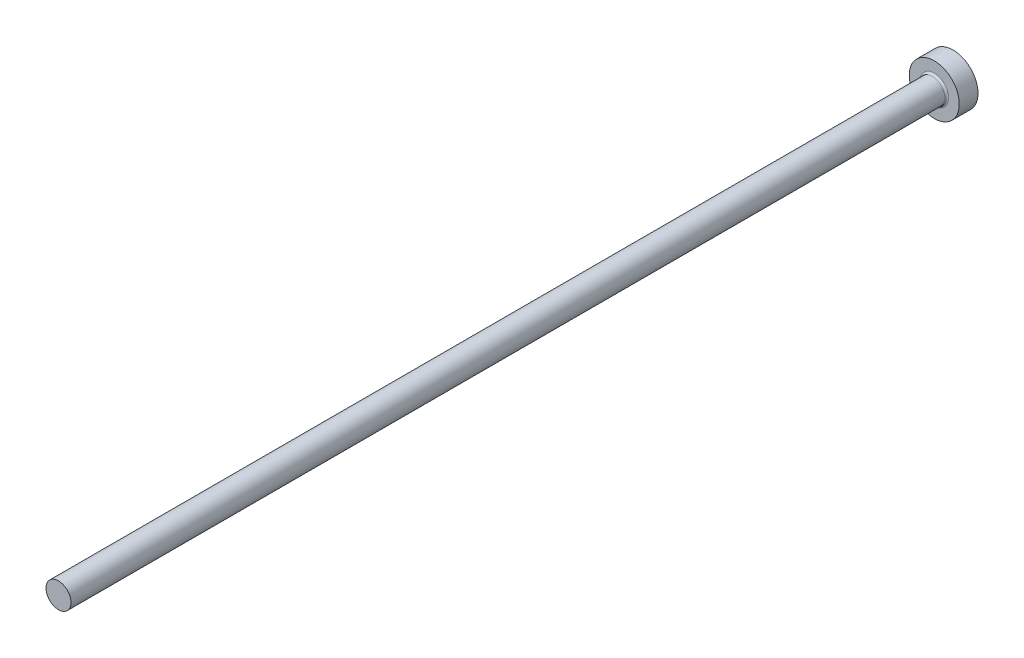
ISO-10303-21;
HEADER;
FILE_DESCRIPTION(('STEP AP214'),'2;1');
FILE_NAME('part.step','',(''),(''),'','','');
FILE_SCHEMA(('AUTOMOTIVE_DESIGN { 1 0 10303 214 1 1 1 1 }'));
ENDSEC;
DATA;
#1=APPLICATION_CONTEXT('core data for automotive mechanical design processes');
#2=APPLICATION_PROTOCOL_DEFINITION('international standard','automotive_design',2000,#1);
#3=PRODUCT_CONTEXT('',#1,'mechanical');
#4=PRODUCT('Part','Part','',(#3));
#5=PRODUCT_RELATED_PRODUCT_CATEGORY('part','',(#4));
#6=PRODUCT_DEFINITION_FORMATION('','',#4);
#7=PRODUCT_DEFINITION_CONTEXT('part definition',#1,'design');
#8=PRODUCT_DEFINITION('design','',#6,#7);
#9=PRODUCT_DEFINITION_SHAPE('','',#8);
#10=(LENGTH_UNIT() NAMED_UNIT(*) SI_UNIT(.MILLI.,.METRE.));
#11=(NAMED_UNIT(*) PLANE_ANGLE_UNIT() SI_UNIT($,.RADIAN.));
#12=(NAMED_UNIT(*) SI_UNIT($,.STERADIAN.) SOLID_ANGLE_UNIT());
#13=UNCERTAINTY_MEASURE_WITH_UNIT(LENGTH_MEASURE(1.E-05),#10,'distance_accuracy_value','');
#14=(GEOMETRIC_REPRESENTATION_CONTEXT(3) GLOBAL_UNCERTAINTY_ASSIGNED_CONTEXT((#13)) GLOBAL_UNIT_ASSIGNED_CONTEXT((#10,
#11,#12)) REPRESENTATION_CONTEXT('',''));
#15=CARTESIAN_POINT('',(0.,0.,0.));
#16=DIRECTION('',(0.,0.,1.));
#17=DIRECTION('',(1.,0.,0.));
#18=AXIS2_PLACEMENT_3D('',#15,#16,#17);
#19=CARTESIAN_POINT('',(37.2670416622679,36.261,-129.9996));
#20=DIRECTION('',(0.,0.,1.));
#21=DIRECTION('',(1.,0.,0.));
#22=AXIS2_PLACEMENT_3D('',#19,#20,#21);
#23=CYLINDRICAL_SURFACE('',#22,2.);
#24=CARTESIAN_POINT('',(37.2670416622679,36.261,-139.7));
#25=DIRECTION('',(0.,0.,-1.));
#26=DIRECTION('',(-1.,0.,0.));
#27=AXIS2_PLACEMENT_3D('',#24,#25,#26);
#28=CIRCLE('',#27,2.);
#29=CARTESIAN_POINT('',(35.2670416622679,36.261,-139.7));
#30=VERTEX_POINT('',#29);
#31=EDGE_CURVE('E10',#30,#30,#28,.F.);
#32=ORIENTED_EDGE('',*,*,#31,.T.);
#33=EDGE_LOOP('',(#32));
#34=FACE_BOUND('',#33,.T.);
#35=CARTESIAN_POINT('',(37.2670416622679,36.261,0.000399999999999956));
#36=DIRECTION('',(0.,0.,-1.));
#37=DIRECTION('',(1.,0.,0.));
#38=AXIS2_PLACEMENT_3D('',#35,#36,#37);
#39=CIRCLE('',#38,2.);
#40=CARTESIAN_POINT('',(39.2670416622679,36.261,0.000399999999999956));
#41=VERTEX_POINT('',#40);
#42=EDGE_CURVE('E25',#41,#41,#39,.T.);
#43=ORIENTED_EDGE('',*,*,#42,.T.);
#44=EDGE_LOOP('',(#43));
#45=FACE_BOUND('',#44,.T.);
#46=ADVANCED_FACE('F14',(#34,#45),#23,.T.);
#47=CARTESIAN_POINT('',(37.2670416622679,36.261,0.000399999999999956));
#48=DIRECTION('',(0.,0.,-1.));
#49=DIRECTION('',(-1.,0.,0.));
#50=AXIS2_PLACEMENT_3D('',#47,#48,#49);
#51=PLANE('',#50);
#52=ORIENTED_EDGE('',*,*,#42,.F.);
#53=EDGE_LOOP('',(#52));
#54=FACE_BOUND('',#53,.T.);
#55=ADVANCED_FACE('F43',(#54),#51,.F.);
#56=CARTESIAN_POINT('',(37.2670416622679,36.261,-140.));
#57=DIRECTION('',(0.,0.,-1.));
#58=DIRECTION('',(-1.,0.,0.));
#59=AXIS2_PLACEMENT_3D('',#56,#57,#58);
#60=PLANE('',#59);
#61=CARTESIAN_POINT('',(37.2670416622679,36.261,-140.));
#62=DIRECTION('',(0.,0.,-1.));
#63=DIRECTION('',(-1.,0.,0.));
#64=AXIS2_PLACEMENT_3D('',#61,#62,#63);
#65=CIRCLE('',#64,2.3);
#66=CARTESIAN_POINT('',(34.9670416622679,36.261,-140.));
#67=VERTEX_POINT('',#66);
#68=EDGE_CURVE('E21',#67,#67,#65,.T.);
#69=ORIENTED_EDGE('',*,*,#68,.T.);
#70=EDGE_LOOP('',(#69));
#71=FACE_BOUND('',#70,.T.);
#72=CARTESIAN_POINT('',(37.2670416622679,36.261,-140.));
#73=DIRECTION('',(0.,0.,-1.));
#74=DIRECTION('',(-1.,0.,0.));
#75=AXIS2_PLACEMENT_3D('',#72,#73,#74);
#76=CIRCLE('',#75,4.);
#77=CARTESIAN_POINT('',(33.2670416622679,36.261,-140.));
#78=VERTEX_POINT('',#77);
#79=EDGE_CURVE('E29',#78,#78,#76,.T.);
#80=ORIENTED_EDGE('',*,*,#79,.F.);
#81=EDGE_LOOP('',(#80));
#82=FACE_BOUND('',#81,.T.);
#83=ADVANCED_FACE('F41',(#71,#82),#60,.F.);
#84=CARTESIAN_POINT('',(37.2670416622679,36.261,-140.));
#85=DIRECTION('',(0.,0.,-1.));
#86=DIRECTION('',(-1.,0.,0.));
#87=AXIS2_PLACEMENT_3D('',#84,#85,#86);
#88=CYLINDRICAL_SURFACE('',#87,4.);
#89=ORIENTED_EDGE('',*,*,#79,.T.);
#90=EDGE_LOOP('',(#89));
#91=FACE_BOUND('',#90,.T.);
#92=CARTESIAN_POINT('',(37.2670416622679,36.261,-143.));
#93=DIRECTION('',(0.,0.,-1.));
#94=DIRECTION('',(-1.,0.,0.));
#95=AXIS2_PLACEMENT_3D('',#92,#93,#94);
#96=CIRCLE('',#95,4.);
#97=CARTESIAN_POINT('',(33.2670416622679,36.261,-143.));
#98=VERTEX_POINT('',#97);
#99=EDGE_CURVE('E32',#98,#98,#96,.T.);
#100=ORIENTED_EDGE('',*,*,#99,.F.);
#101=EDGE_LOOP('',(#100));
#102=FACE_BOUND('',#101,.T.);
#103=ADVANCED_FACE('F38',(#91,#102),#88,.T.);
#104=CARTESIAN_POINT('',(198.,-100.,-143.));
#105=DIRECTION('',(0.,0.,-1.));
#106=DIRECTION('',(-1.,0.,0.));
#107=AXIS2_PLACEMENT_3D('',#104,#105,#106);
#108=PLANE('',#107);
#109=ORIENTED_EDGE('',*,*,#99,.T.);
#110=EDGE_LOOP('',(#109));
#111=FACE_BOUND('',#110,.T.);
#112=ADVANCED_FACE('F50',(#111),#108,.T.);
#113=CARTESIAN_POINT('',(37.2670416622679,36.261,-139.7));
#114=DIRECTION('',(0.,0.,-1.));
#115=DIRECTION('',(-1.,0.,0.));
#116=AXIS2_PLACEMENT_3D('',#113,#114,#115);
#117=TOROIDAL_SURFACE('',#116,2.3,0.3);
#118=ORIENTED_EDGE('',*,*,#31,.F.);
#119=EDGE_LOOP('',(#118));
#120=FACE_BOUND('',#119,.T.);
#121=ORIENTED_EDGE('',*,*,#68,.F.);
#122=EDGE_LOOP('',(#121));
#123=FACE_BOUND('',#122,.T.);
#124=ADVANCED_FACE('F16',(#120,#123),#117,.F.);
#125=CLOSED_SHELL('',(#46,#55,#83,#103,#112,#124));
#126=MANIFOLD_SOLID_BREP('B1',#125);
#127=ADVANCED_BREP_SHAPE_REPRESENTATION('',(#18,#126),#14);
#128=SHAPE_DEFINITION_REPRESENTATION(#9,#127);
ENDSEC;
END-ISO-10303-21;
